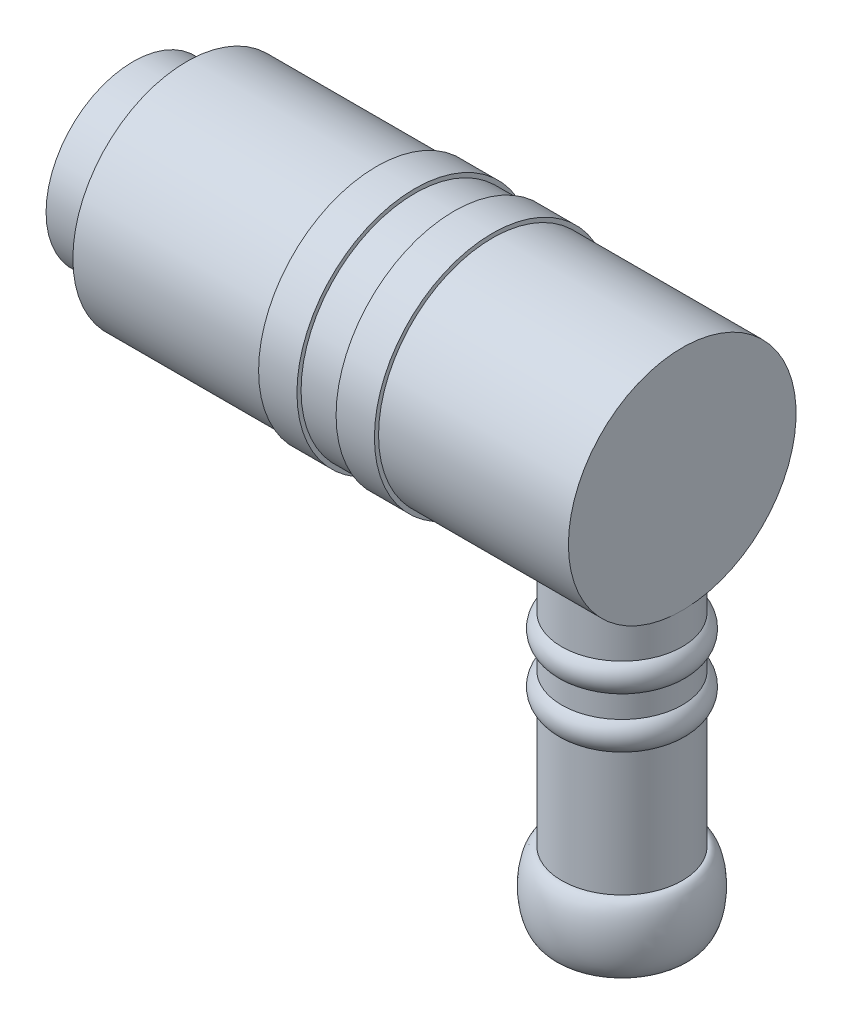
ISO-10303-21;
HEADER;
FILE_DESCRIPTION(('STEP AP214'),'2;1');
FILE_NAME('part.step','',(''),(''),'','','');
FILE_SCHEMA(('AUTOMOTIVE_DESIGN { 1 0 10303 214 1 1 1 1 }'));
ENDSEC;
DATA;
#1=APPLICATION_CONTEXT('core data for automotive mechanical design processes');
#2=APPLICATION_PROTOCOL_DEFINITION('international standard','automotive_design',2000,#1);
#3=PRODUCT_CONTEXT('',#1,'mechanical');
#4=PRODUCT('Part','Part','',(#3));
#5=PRODUCT_RELATED_PRODUCT_CATEGORY('part','',(#4));
#6=PRODUCT_DEFINITION_FORMATION('','',#4);
#7=PRODUCT_DEFINITION_CONTEXT('part definition',#1,'design');
#8=PRODUCT_DEFINITION('design','',#6,#7);
#9=PRODUCT_DEFINITION_SHAPE('','',#8);
#10=(LENGTH_UNIT() NAMED_UNIT(*) SI_UNIT(.MILLI.,.METRE.));
#11=(NAMED_UNIT(*) PLANE_ANGLE_UNIT() SI_UNIT($,.RADIAN.));
#12=(NAMED_UNIT(*) SI_UNIT($,.STERADIAN.) SOLID_ANGLE_UNIT());
#13=UNCERTAINTY_MEASURE_WITH_UNIT(LENGTH_MEASURE(1.E-05),#10,'distance_accuracy_value','');
#14=(GEOMETRIC_REPRESENTATION_CONTEXT(3) GLOBAL_UNCERTAINTY_ASSIGNED_CONTEXT((#13)) GLOBAL_UNIT_ASSIGNED_CONTEXT((#10,
#11,#12)) REPRESENTATION_CONTEXT('',''));
#15=CARTESIAN_POINT('',(0.,0.,0.));
#16=DIRECTION('',(0.,0.,1.));
#17=DIRECTION('',(1.,0.,0.));
#18=AXIS2_PLACEMENT_3D('',#15,#16,#17);
#19=CARTESIAN_POINT('',(36.5,-11.9034368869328,0.));
#20=DIRECTION('',(0.,1.,0.));
#21=DIRECTION('',(0.,0.,1.));
#22=AXIS2_PLACEMENT_3D('',#19,#20,#21);
#23=TOROIDAL_SURFACE('',#22,3.75173905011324,1.29418465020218);
#24=CARTESIAN_POINT('',(36.5,-10.8474920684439,0.));
#25=DIRECTION('',(0.,1.,0.));
#26=DIRECTION('',(0.,0.,1.));
#27=AXIS2_PLACEMENT_3D('',#24,#25,#26);
#28=CIRCLE('',#27,4.5);
#29=CARTESIAN_POINT('',(36.5,-10.8474920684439,4.5));
#30=VERTEX_POINT('',#29);
#31=EDGE_CURVE('P0_E9',#30,#30,#28,.T.);
#32=ORIENTED_EDGE('',*,*,#31,.F.);
#33=EDGE_LOOP('',(#32));
#34=FACE_BOUND('',#33,.T.);
#35=CARTESIAN_POINT('',(36.5,-12.9593817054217,0.));
#36=DIRECTION('',(0.,1.,0.));
#37=DIRECTION('',(0.,0.,1.));
#38=AXIS2_PLACEMENT_3D('',#35,#36,#37);
#39=CIRCLE('',#38,4.5);
#40=CARTESIAN_POINT('',(36.5,-12.9593817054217,4.5));
#41=VERTEX_POINT('',#40);
#42=EDGE_CURVE('P0_E45',#41,#41,#39,.T.);
#43=ORIENTED_EDGE('',*,*,#42,.T.);
#44=EDGE_LOOP('',(#43));
#45=FACE_BOUND('',#44,.T.);
#46=ADVANCED_FACE('P0_F14',(#34,#45),#23,.T.);
#47=CARTESIAN_POINT('',(36.5,-7.25890660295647,0.));
#48=DIRECTION('',(0.,1.,0.));
#49=DIRECTION('',(0.,0.,1.));
#50=AXIS2_PLACEMENT_3D('',#47,#48,#49);
#51=CYLINDRICAL_SURFACE('',#50,4.5);
#52=CARTESIAN_POINT('',(36.5,-7.25890660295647,0.));
#53=DIRECTION('',(0.,1.,0.));
#54=DIRECTION('',(0.,0.,1.));
#55=AXIS2_PLACEMENT_3D('',#52,#53,#54);
#56=CIRCLE('',#55,4.5);
#57=CARTESIAN_POINT('',(36.5,-7.25890660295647,4.5));
#58=VERTEX_POINT('',#57);
#59=EDGE_CURVE('P0_E20',#58,#58,#56,.T.);
#60=ORIENTED_EDGE('',*,*,#59,.F.);
#61=EDGE_LOOP('',(#60));
#62=FACE_BOUND('',#61,.T.);
#63=ORIENTED_EDGE('',*,*,#31,.T.);
#64=EDGE_LOOP('',(#63));
#65=FACE_BOUND('',#64,.T.);
#66=ADVANCED_FACE('P0_F67',(#62,#65),#51,.T.);
#67=CARTESIAN_POINT('',(39.5,-7.25890660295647,0.));
#68=DIRECTION('',(0.,-1.,0.));
#69=DIRECTION('',(0.,0.,-1.));
#70=AXIS2_PLACEMENT_3D('',#67,#68,#69);
#71=PLANE('',#70);
#72=CARTESIAN_POINT('',(36.5,-7.25890660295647,0.));
#73=DIRECTION('',(0.,1.,0.));
#74=DIRECTION('',(0.,0.,1.));
#75=AXIS2_PLACEMENT_3D('',#72,#73,#74);
#76=CIRCLE('',#75,3.);
#77=CARTESIAN_POINT('',(36.5,-7.25890660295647,3.));
#78=VERTEX_POINT('',#77);
#79=EDGE_CURVE('P0_E24',#78,#78,#76,.T.);
#80=ORIENTED_EDGE('',*,*,#79,.F.);
#81=EDGE_LOOP('',(#80));
#82=FACE_BOUND('',#81,.T.);
#83=ORIENTED_EDGE('',*,*,#59,.T.);
#84=EDGE_LOOP('',(#83));
#85=FACE_BOUND('',#84,.T.);
#86=ADVANCED_FACE('P0_F64',(#82,#85),#71,.F.);
#87=CARTESIAN_POINT('',(36.5,-7.25890660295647,0.));
#88=DIRECTION('',(0.,1.,0.));
#89=DIRECTION('',(0.,0.,1.));
#90=AXIS2_PLACEMENT_3D('',#87,#88,#89);
#91=CYLINDRICAL_SURFACE('',#90,3.);
#92=CARTESIAN_POINT('',(36.5,-31.2588721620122,0.));
#93=DIRECTION('',(0.,1.,0.));
#94=DIRECTION('',(0.,0.,1.));
#95=AXIS2_PLACEMENT_3D('',#92,#93,#94);
#96=CIRCLE('',#95,3.);
#97=CARTESIAN_POINT('',(36.5,-31.2588721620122,3.));
#98=VERTEX_POINT('',#97);
#99=EDGE_CURVE('P0_E28',#98,#98,#96,.T.);
#100=ORIENTED_EDGE('',*,*,#99,.F.);
#101=EDGE_LOOP('',(#100));
#102=FACE_BOUND('',#101,.T.);
#103=ORIENTED_EDGE('',*,*,#79,.T.);
#104=EDGE_LOOP('',(#103));
#105=FACE_BOUND('',#104,.T.);
#106=ADVANCED_FACE('P0_F60',(#102,#105),#91,.F.);
#107=CARTESIAN_POINT('',(40.9593408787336,-31.2588721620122,0.));
#108=DIRECTION('',(0.,1.,0.));
#109=DIRECTION('',(0.,0.,1.));
#110=AXIS2_PLACEMENT_3D('',#107,#108,#109);
#111=PLANE('',#110);
#112=CARTESIAN_POINT('',(36.5,-31.2588721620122,0.));
#113=DIRECTION('',(0.,1.,0.));
#114=DIRECTION('',(0.,0.,1.));
#115=AXIS2_PLACEMENT_3D('',#112,#113,#114);
#116=CIRCLE('',#115,4.45934087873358);
#117=CARTESIAN_POINT('',(36.5,-31.2588721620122,4.45934087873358));
#118=VERTEX_POINT('',#117);
#119=EDGE_CURVE('P0_E33',#118,#118,#116,.T.);
#120=ORIENTED_EDGE('',*,*,#119,.F.);
#121=EDGE_LOOP('',(#120));
#122=FACE_BOUND('',#121,.T.);
#123=ORIENTED_EDGE('',*,*,#99,.T.);
#124=EDGE_LOOP('',(#123));
#125=FACE_BOUND('',#124,.T.);
#126=ADVANCED_FACE('P0_F55',(#122,#125),#111,.F.);
#127=CARTESIAN_POINT('',(41.,-28.611956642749,0.));
#128=DIRECTION('',(0.,0.,1.));
#129=DIRECTION('',(-0.0153591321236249,-0.999882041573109,0.));
#130=AXIS2_PLACEMENT_3D('',#127,#128,#129);
#131=ELLIPSE('',#130,2.64722778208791,1.02803517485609);
#132=CARTESIAN_POINT('',(36.5,-7.25890660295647,0.));
#133=DIRECTION('',(0.,1.,0.));
#134=AXIS1_PLACEMENT('',#132,#133);
#135=SURFACE_OF_REVOLUTION('',#131,#134);
#136=CARTESIAN_POINT('',(36.5,-25.9664853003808,0.));
#137=DIRECTION('',(0.,1.,0.));
#138=DIRECTION('',(0.,0.,1.));
#139=AXIS2_PLACEMENT_3D('',#136,#137,#138);
#140=CIRCLE('',#139,4.5);
#141=CARTESIAN_POINT('',(36.5,-25.9664853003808,4.5));
#142=VERTEX_POINT('',#141);
#143=EDGE_CURVE('P0_E36',#142,#142,#140,.T.);
#144=ORIENTED_EDGE('',*,*,#143,.F.);
#145=EDGE_LOOP('',(#144));
#146=FACE_BOUND('',#145,.T.);
#147=ORIENTED_EDGE('',*,*,#119,.T.);
#148=EDGE_LOOP('',(#147));
#149=FACE_BOUND('',#148,.T.);
#150=ADVANCED_FACE('P0_F50',(#146,#149),#135,.T.);
#151=CARTESIAN_POINT('',(36.5,-7.25890660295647,0.));
#152=DIRECTION('',(0.,1.,0.));
#153=DIRECTION('',(0.,0.,1.));
#154=AXIS2_PLACEMENT_3D('',#151,#152,#153);
#155=CYLINDRICAL_SURFACE('',#154,4.5);
#156=CARTESIAN_POINT('',(36.5,-16.7283224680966,0.));
#157=DIRECTION('',(0.,1.,0.));
#158=DIRECTION('',(0.,0.,1.));
#159=AXIS2_PLACEMENT_3D('',#156,#157,#158);
#160=CIRCLE('',#159,4.5);
#161=CARTESIAN_POINT('',(36.5,-16.7283224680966,4.5));
#162=VERTEX_POINT('',#161);
#163=EDGE_CURVE('P0_E39',#162,#162,#160,.T.);
#164=ORIENTED_EDGE('',*,*,#163,.F.);
#165=EDGE_LOOP('',(#164));
#166=FACE_BOUND('',#165,.T.);
#167=ORIENTED_EDGE('',*,*,#143,.T.);
#168=EDGE_LOOP('',(#167));
#169=FACE_BOUND('',#168,.T.);
#170=ADVANCED_FACE('P0_F54',(#166,#169),#155,.T.);
#171=CARTESIAN_POINT('',(36.5,-15.6723776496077,0.));
#172=DIRECTION('',(0.,1.,0.));
#173=DIRECTION('',(0.,0.,1.));
#174=AXIS2_PLACEMENT_3D('',#171,#172,#173);
#175=TOROIDAL_SURFACE('',#174,3.75173905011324,1.29418465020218);
#176=CARTESIAN_POINT('',(36.5,-14.6164328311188,0.));
#177=DIRECTION('',(0.,1.,0.));
#178=DIRECTION('',(0.,0.,1.));
#179=AXIS2_PLACEMENT_3D('',#176,#177,#178);
#180=CIRCLE('',#179,4.5);
#181=CARTESIAN_POINT('',(36.5,-14.6164328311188,4.5));
#182=VERTEX_POINT('',#181);
#183=EDGE_CURVE('P0_E42',#182,#182,#180,.T.);
#184=ORIENTED_EDGE('',*,*,#183,.F.);
#185=EDGE_LOOP('',(#184));
#186=FACE_BOUND('',#185,.T.);
#187=ORIENTED_EDGE('',*,*,#163,.T.);
#188=EDGE_LOOP('',(#187));
#189=FACE_BOUND('',#188,.T.);
#190=ADVANCED_FACE('P0_F86',(#186,#189),#175,.T.);
#191=CARTESIAN_POINT('',(36.5,-7.25890660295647,0.));
#192=DIRECTION('',(0.,1.,0.));
#193=DIRECTION('',(0.,0.,1.));
#194=AXIS2_PLACEMENT_3D('',#191,#192,#193);
#195=CYLINDRICAL_SURFACE('',#194,4.5);
#196=ORIENTED_EDGE('',*,*,#42,.F.);
#197=EDGE_LOOP('',(#196));
#198=FACE_BOUND('',#197,.T.);
#199=ORIENTED_EDGE('',*,*,#183,.T.);
#200=EDGE_LOOP('',(#199));
#201=FACE_BOUND('',#200,.T.);
#202=ADVANCED_FACE('P0_F83',(#198,#201),#195,.T.);
#203=CLOSED_SHELL('',(#46,#66,#86,#106,#126,#150,#170,#190,#202));
#204=MANIFOLD_SOLID_BREP('P0_B1',#203);
#205=CARTESIAN_POINT('',(18.1763793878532,8.5,0.));
#206=DIRECTION('',(1.,0.,0.));
#207=DIRECTION('',(0.,0.,-1.));
#208=AXIS2_PLACEMENT_3D('',#205,#206,#207);
#209=PLANE('',#208);
#210=CARTESIAN_POINT('',(18.1763793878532,0.,0.));
#211=DIRECTION('',(-1.,0.,0.));
#212=DIRECTION('',(0.,0.,1.));
#213=AXIS2_PLACEMENT_3D('',#210,#211,#212);
#214=CIRCLE('',#213,8.5);
#215=CARTESIAN_POINT('',(18.1763793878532,0.,8.5));
#216=VERTEX_POINT('',#215);
#217=EDGE_CURVE('P1_E113',#216,#216,#214,.T.);
#218=ORIENTED_EDGE('',*,*,#217,.F.);
#219=EDGE_LOOP('',(#218));
#220=FACE_BOUND('',#219,.T.);
#221=CARTESIAN_POINT('',(18.1763793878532,0.,0.));
#222=DIRECTION('',(-1.,0.,0.));
#223=DIRECTION('',(0.,0.,1.));
#224=AXIS2_PLACEMENT_3D('',#221,#222,#223);
#225=CIRCLE('',#224,8.80809565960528);
#226=CARTESIAN_POINT('',(18.1763793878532,0.,8.80809565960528));
#227=VERTEX_POINT('',#226);
#228=EDGE_CURVE('P1_E155',#227,#227,#225,.T.);
#229=ORIENTED_EDGE('',*,*,#228,.T.);
#230=EDGE_LOOP('',(#229));
#231=FACE_BOUND('',#230,.T.);
#232=ADVANCED_FACE('P1_F16',(#220,#231),#209,.F.);
#233=CARTESIAN_POINT('',(0.,0.,0.));
#234=DIRECTION('',(-1.,0.,0.));
#235=DIRECTION('',(0.,0.,1.));
#236=AXIS2_PLACEMENT_3D('',#233,#234,#235);
#237=CYLINDRICAL_SURFACE('',#236,8.80809565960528);
#238=ORIENTED_EDGE('',*,*,#228,.F.);
#239=EDGE_LOOP('',(#238));
#240=FACE_BOUND('',#239,.T.);
#241=CARTESIAN_POINT('',(21.0389220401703,0.,0.));
#242=DIRECTION('',(-1.,0.,0.));
#243=DIRECTION('',(0.,0.,1.));
#244=AXIS2_PLACEMENT_3D('',#241,#242,#243);
#245=CIRCLE('',#244,8.80809565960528);
#246=CARTESIAN_POINT('',(21.0389220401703,0.,8.80809565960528));
#247=VERTEX_POINT('',#246);
#248=EDGE_CURVE('P1_E158',#247,#247,#245,.T.);
#249=ORIENTED_EDGE('',*,*,#248,.T.);
#250=EDGE_LOOP('',(#249));
#251=FACE_BOUND('',#250,.T.);
#252=ADVANCED_FACE('P1_F142',(#240,#251),#237,.T.);
#253=CARTESIAN_POINT('',(21.0389220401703,8.80809565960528,0.));
#254=DIRECTION('',(-1.,0.,0.));
#255=DIRECTION('',(0.,0.,1.));
#256=AXIS2_PLACEMENT_3D('',#253,#254,#255);
#257=PLANE('',#256);
#258=ORIENTED_EDGE('',*,*,#248,.F.);
#259=EDGE_LOOP('',(#258));
#260=FACE_BOUND('',#259,.T.);
#261=CARTESIAN_POINT('',(21.0389220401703,0.,0.));
#262=DIRECTION('',(-1.,0.,0.));
#263=DIRECTION('',(0.,0.,1.));
#264=AXIS2_PLACEMENT_3D('',#261,#262,#263);
#265=CIRCLE('',#264,8.5);
#266=CARTESIAN_POINT('',(21.0389220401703,0.,8.5));
#267=VERTEX_POINT('',#266);
#268=EDGE_CURVE('P1_E159',#267,#267,#265,.T.);
#269=ORIENTED_EDGE('',*,*,#268,.T.);
#270=EDGE_LOOP('',(#269));
#271=FACE_BOUND('',#270,.T.);
#272=ADVANCED_FACE('P1_F139',(#260,#271),#257,.F.);
#273=CARTESIAN_POINT('',(0.,0.,0.));
#274=DIRECTION('',(-1.,0.,0.));
#275=DIRECTION('',(0.,0.,1.));
#276=AXIS2_PLACEMENT_3D('',#273,#274,#275);
#277=CYLINDRICAL_SURFACE('',#276,8.5);
#278=ORIENTED_EDGE('',*,*,#268,.F.);
#279=EDGE_LOOP('',(#278));
#280=FACE_BOUND('',#279,.T.);
#281=CARTESIAN_POINT('',(23.9610779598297,0.,0.));
#282=DIRECTION('',(-1.,0.,0.));
#283=DIRECTION('',(0.,0.,1.));
#284=AXIS2_PLACEMENT_3D('',#281,#282,#283);
#285=CIRCLE('',#284,8.5);
#286=CARTESIAN_POINT('',(23.9610779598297,0.,8.5));
#287=VERTEX_POINT('',#286);
#288=EDGE_CURVE('P1_E164',#287,#287,#285,.T.);
#289=ORIENTED_EDGE('',*,*,#288,.T.);
#290=EDGE_LOOP('',(#289));
#291=FACE_BOUND('',#290,.T.);
#292=ADVANCED_FACE('P1_F135',(#280,#291),#277,.T.);
#293=CARTESIAN_POINT('',(23.9610779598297,8.80809565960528,0.));
#294=DIRECTION('',(1.,0.,0.));
#295=DIRECTION('',(0.,0.,-1.));
#296=AXIS2_PLACEMENT_3D('',#293,#294,#295);
#297=PLANE('',#296);
#298=ORIENTED_EDGE('',*,*,#288,.F.);
#299=EDGE_LOOP('',(#298));
#300=FACE_BOUND('',#299,.T.);
#301=CARTESIAN_POINT('',(23.9610779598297,0.,0.));
#302=DIRECTION('',(-1.,0.,0.));
#303=DIRECTION('',(0.,0.,1.));
#304=AXIS2_PLACEMENT_3D('',#301,#302,#303);
#305=CIRCLE('',#304,8.80809565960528);
#306=CARTESIAN_POINT('',(23.9610779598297,0.,8.80809565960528));
#307=VERTEX_POINT('',#306);
#308=EDGE_CURVE('P1_E191',#307,#307,#305,.T.);
#309=ORIENTED_EDGE('',*,*,#308,.T.);
#310=EDGE_LOOP('',(#309));
#311=FACE_BOUND('',#310,.T.);
#312=ADVANCED_FACE('P1_F131',(#300,#311),#297,.F.);
#313=CARTESIAN_POINT('',(0.,0.,0.));
#314=DIRECTION('',(-1.,0.,0.));
#315=DIRECTION('',(0.,0.,1.));
#316=AXIS2_PLACEMENT_3D('',#313,#314,#315);
#317=CYLINDRICAL_SURFACE('',#316,8.80809565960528);
#318=ORIENTED_EDGE('',*,*,#308,.F.);
#319=EDGE_LOOP('',(#318));
#320=FACE_BOUND('',#319,.T.);
#321=CARTESIAN_POINT('',(26.8236206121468,0.,0.));
#322=DIRECTION('',(-1.,0.,0.));
#323=DIRECTION('',(0.,0.,1.));
#324=AXIS2_PLACEMENT_3D('',#321,#322,#323);
#325=CIRCLE('',#324,8.80809565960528);
#326=CARTESIAN_POINT('',(26.8236206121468,0.,8.80809565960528));
#327=VERTEX_POINT('',#326);
#328=EDGE_CURVE('P1_E188',#327,#327,#325,.T.);
#329=ORIENTED_EDGE('',*,*,#328,.T.);
#330=EDGE_LOOP('',(#329));
#331=FACE_BOUND('',#330,.T.);
#332=ADVANCED_FACE('P1_F127',(#320,#331),#317,.T.);
#333=CARTESIAN_POINT('',(26.8236206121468,8.5,0.));
#334=DIRECTION('',(-1.,0.,0.));
#335=DIRECTION('',(0.,0.,1.));
#336=AXIS2_PLACEMENT_3D('',#333,#334,#335);
#337=PLANE('',#336);
#338=ORIENTED_EDGE('',*,*,#328,.F.);
#339=EDGE_LOOP('',(#338));
#340=FACE_BOUND('',#339,.T.);
#341=CARTESIAN_POINT('',(26.8236206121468,0.,0.));
#342=DIRECTION('',(-1.,0.,0.));
#343=DIRECTION('',(0.,0.,1.));
#344=AXIS2_PLACEMENT_3D('',#341,#342,#343);
#345=CIRCLE('',#344,8.5);
#346=CARTESIAN_POINT('',(26.8236206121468,0.,8.5));
#347=VERTEX_POINT('',#346);
#348=EDGE_CURVE('P1_E179',#347,#347,#345,.T.);
#349=ORIENTED_EDGE('',*,*,#348,.T.);
#350=EDGE_LOOP('',(#349));
#351=FACE_BOUND('',#350,.T.);
#352=ADVANCED_FACE('P1_F123',(#340,#351),#337,.F.);
#353=CARTESIAN_POINT('',(0.,0.,0.));
#354=DIRECTION('',(-1.,0.,0.));
#355=DIRECTION('',(0.,0.,1.));
#356=AXIS2_PLACEMENT_3D('',#353,#354,#355);
#357=CYLINDRICAL_SURFACE('',#356,8.5);
#358=CARTESIAN_POINT('',(36.5,-8.26135582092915,-2.));
#359=CARTESIAN_POINT('',(36.3893406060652,-8.26135802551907,-1.99999651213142));
#360=CARTESIAN_POINT('',(36.2786410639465,-8.26360346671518,-1.99078460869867));
#361=CARTESIAN_POINT('',(36.0604059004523,-8.27232284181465,-1.95423010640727));
#362=CARTESIAN_POINT('',(35.9528723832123,-8.2787995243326,-1.92687572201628));
#363=CARTESIAN_POINT('',(35.744157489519,-8.29520817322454,-1.85495833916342));
#364=CARTESIAN_POINT('',(35.6429686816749,-8.30513600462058,-1.81041592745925));
#365=CARTESIAN_POINT('',(35.4494931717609,-8.32732327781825,-1.70544786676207));
#366=CARTESIAN_POINT('',(35.3572065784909,-8.33958274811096,-1.64502202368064));
#367=CARTESIAN_POINT('',(35.1823536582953,-8.36531956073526,-1.50874395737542));
#368=CARTESIAN_POINT('',(35.0999865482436,-8.37881451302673,-1.43263940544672));
#369=CARTESIAN_POINT('',(34.9490607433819,-8.40534831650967,-1.26770837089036));
#370=CARTESIAN_POINT('',(34.8805032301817,-8.41838712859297,-1.17888080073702));
#371=CARTESIAN_POINT('',(34.7583407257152,-8.44273291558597,-0.989674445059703));
#372=CARTESIAN_POINT('',(34.7049294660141,-8.45401668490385,-0.889167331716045));
#373=CARTESIAN_POINT('',(34.6158321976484,-8.47338106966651,-0.680292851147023));
#374=CARTESIAN_POINT('',(34.5801438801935,-8.48146210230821,-0.571926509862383));
#375=CARTESIAN_POINT('',(34.5281380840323,-8.49338603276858,-0.352484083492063));
#376=CARTESIAN_POINT('',(34.5114828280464,-8.49730274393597,-0.241492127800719));
#377=CARTESIAN_POINT('',(34.4969577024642,-8.5007132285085,-0.0182250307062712));
#378=CARTESIAN_POINT('',(34.4990853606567,-8.50020758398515,0.0940499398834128));
#379=CARTESIAN_POINT('',(34.5218185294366,-8.49488598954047,0.314360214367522));
#380=CARTESIAN_POINT('',(34.5420597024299,-8.49015503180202,0.422435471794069));
#381=CARTESIAN_POINT('',(34.5998621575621,-8.47701229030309,0.633610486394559));
#382=CARTESIAN_POINT('',(34.6374242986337,-8.4686003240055,0.736709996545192));
#383=CARTESIAN_POINT('',(34.7291104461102,-8.44890746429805,0.935991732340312));
#384=CARTESIAN_POINT('',(34.7833681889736,-8.43760353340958,1.03211005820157));
#385=CARTESIAN_POINT('',(34.9068047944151,-8.41335949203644,1.21400773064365));
#386=CARTESIAN_POINT('',(34.9759859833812,-8.40041912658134,1.29978546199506));
#387=CARTESIAN_POINT('',(35.1292738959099,-8.37395173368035,1.46073740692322));
#388=CARTESIAN_POINT('',(35.2136993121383,-8.36041808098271,1.53560731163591));
#389=CARTESIAN_POINT('',(35.394048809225,-8.33457724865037,1.67018914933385));
#390=CARTESIAN_POINT('',(35.489973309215,-8.32227011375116,1.72990052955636));
#391=CARTESIAN_POINT('',(35.691143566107,-8.30025483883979,1.83263569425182));
#392=CARTESIAN_POINT('',(35.796423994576,-8.29055695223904,1.87559393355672));
#393=CARTESIAN_POINT('',(36.0129937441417,-8.27499423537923,1.94311185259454));
#394=CARTESIAN_POINT('',(36.1242819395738,-8.26912868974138,1.96767496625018));
#395=CARTESIAN_POINT('',(36.3469061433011,-8.2620429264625,1.99721658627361));
#396=CARTESIAN_POINT('',(36.4581795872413,-8.2607167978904,2.0026417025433));
#397=CARTESIAN_POINT('',(36.6800412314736,-8.2625729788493,1.99496945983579));
#398=CARTESIAN_POINT('',(36.7906294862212,-8.26575492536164,1.98187359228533));
#399=CARTESIAN_POINT('',(37.0063738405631,-8.27616794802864,1.93792079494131));
#400=CARTESIAN_POINT('',(37.1115845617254,-8.28334127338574,1.90731701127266));
#401=CARTESIAN_POINT('',(37.3153840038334,-8.30087529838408,1.82949455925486));
#402=CARTESIAN_POINT('',(37.4139720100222,-8.31123634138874,1.78227410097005));
#403=CARTESIAN_POINT('',(37.6036394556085,-8.33420606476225,1.67160019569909));
#404=CARTESIAN_POINT('',(37.6945562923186,-8.34685107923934,1.60787579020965));
#405=CARTESIAN_POINT('',(37.8645701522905,-8.37287165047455,1.46635124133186));
#406=CARTESIAN_POINT('',(37.9436654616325,-8.38624731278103,1.38854906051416));
#407=CARTESIAN_POINT('',(38.0895632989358,-8.41257627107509,1.21904159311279));
#408=CARTESIAN_POINT('',(38.1560590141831,-8.42551392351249,1.12706936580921));
#409=CARTESIAN_POINT('',(38.2726585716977,-8.44920397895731,0.933002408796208));
#410=CARTESIAN_POINT('',(38.3227632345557,-8.45995649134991,0.830908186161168));
#411=CARTESIAN_POINT('',(38.4047506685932,-8.47799969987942,0.620174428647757));
#412=CARTESIAN_POINT('',(38.4367580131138,-8.48531400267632,0.511585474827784));
#413=CARTESIAN_POINT('',(38.4820243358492,-8.4957594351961,0.290377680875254));
#414=CARTESIAN_POINT('',(38.4952864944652,-8.49889127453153,0.17775952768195));
#415=CARTESIAN_POINT('',(38.5025243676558,-8.50059376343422,-0.0454132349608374));
#416=CARTESIAN_POINT('',(38.4969553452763,-8.49927208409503,-0.155952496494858));
#417=CARTESIAN_POINT('',(38.4677198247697,-8.49245087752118,-0.374472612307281));
#418=CARTESIAN_POINT('',(38.4440537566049,-8.48695144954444,-0.482453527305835));
#419=CARTESIAN_POINT('',(38.3795280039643,-8.47240518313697,-0.692375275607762));
#420=CARTESIAN_POINT('',(38.3387421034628,-8.46337357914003,-0.794339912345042));
#421=CARTESIAN_POINT('',(38.2412031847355,-8.4427202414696,-0.990034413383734));
#422=CARTESIAN_POINT('',(38.1844483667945,-8.43109821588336,-1.0837633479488));
#423=CARTESIAN_POINT('',(38.0551475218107,-8.40621095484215,-1.26251541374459));
#424=CARTESIAN_POINT('',(37.9822870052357,-8.39291565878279,-1.34730688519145));
#425=CARTESIAN_POINT('',(37.8234652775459,-8.36632793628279,-1.50361474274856));
#426=CARTESIAN_POINT('',(37.737500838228,-8.35303551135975,-1.57512784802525));
#427=CARTESIAN_POINT('',(37.5532541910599,-8.3277185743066,-1.7039641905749));
#428=CARTESIAN_POINT('',(37.454796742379,-8.31571778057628,-1.76104180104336));
#429=CARTESIAN_POINT('',(37.2494196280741,-8.29465107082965,-1.85774896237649));
#430=CARTESIAN_POINT('',(37.1425066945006,-8.28558284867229,-1.89739223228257));
#431=CARTESIAN_POINT('',(36.9463577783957,-8.27295300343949,-1.95162562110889));
#432=CARTESIAN_POINT('',(36.858125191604,-8.26863485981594,-1.96972884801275));
#433=CARTESIAN_POINT('',(36.6799371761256,-8.26283546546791,-1.99391706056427));
#434=CARTESIAN_POINT('',(36.5899818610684,-8.2613540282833,-2.00000283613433));
#435=CARTESIAN_POINT('',(36.5,-8.26135582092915,-2.));
#436=B_SPLINE_CURVE_WITH_KNOTS('',3,(#358,#359,#360,#361,#362,#363,#364,#365,#366,#367,#368,
#369,#370,#371,#372,#373,#374,#375,#376,#377,#378,#379,#380,#381,#382,#383,#384,#385,#386,#387,
#388,#389,#390,#391,#392,#393,#394,#395,#396,#397,#398,#399,#400,#401,#402,#403,#404,#405,#406,
#407,#408,#409,#410,#411,#412,#413,#414,#415,#416,#417,#418,#419,#420,#421,#422,#423,#424,#425,
#426,#427,#428,#429,#430,#431,#432,#433,#434,#435),.UNSPECIFIED.,.T.,.F.,(4,2,2,2,2,2,2,2,2,2,2,
2,2,2,2,2,2,2,2,2,2,2,2,2,2,2,2,2,2,2,2,2,2,2,2,2,2,2,4),(0.,0.331648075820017,
0.663511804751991,0.994979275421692,1.32645079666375,1.66374480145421,2.00106765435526,
2.34252829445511,2.6839444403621,3.01920253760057,3.35441650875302,3.68303582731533,
4.01167144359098,4.34301124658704,4.67440273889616,5.01375700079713,5.35312363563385,
5.69380500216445,6.03442275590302,6.36703716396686,6.69962478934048,7.02752088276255,
7.35545230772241,7.68915273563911,8.02290149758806,8.36395228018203,8.70498598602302,
9.04364266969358,9.38224188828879,9.71271422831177,10.0431787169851,10.3722333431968,
10.7013250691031,11.037522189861,11.3738022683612,11.7154685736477,12.0568655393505,
12.3265604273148,12.5962375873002),.UNSPECIFIED.);
#437=CARTESIAN_POINT('',(36.5,-8.26135582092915,-2.));
#438=VERTEX_POINT('',#437);
#439=EDGE_CURVE('P1_E105',#438,#438,#436,.T.);
#440=ORIENTED_EDGE('',*,*,#439,.T.);
#441=EDGE_LOOP('',(#440));
#442=FACE_BOUND('',#441,.T.);
#443=ORIENTED_EDGE('',*,*,#348,.F.);
#444=EDGE_LOOP('',(#443));
#445=FACE_BOUND('',#444,.T.);
#446=CARTESIAN_POINT('',(41.,0.,0.));
#447=DIRECTION('',(-1.,0.,0.));
#448=DIRECTION('',(0.,0.,1.));
#449=AXIS2_PLACEMENT_3D('',#446,#447,#448);
#450=CIRCLE('',#449,8.5);
#451=CARTESIAN_POINT('',(41.,0.,8.5));
#452=VERTEX_POINT('',#451);
#453=EDGE_CURVE('P1_E175',#452,#452,#450,.T.);
#454=ORIENTED_EDGE('',*,*,#453,.T.);
#455=EDGE_LOOP('',(#454));
#456=FACE_BOUND('',#455,.T.);
#457=ADVANCED_FACE('P1_F117',(#442,#445,#456),#357,.T.);
#458=CARTESIAN_POINT('',(41.,4.,0.));
#459=DIRECTION('',(-1.,0.,0.));
#460=DIRECTION('',(0.,0.,1.));
#461=AXIS2_PLACEMENT_3D('',#458,#459,#460);
#462=PLANE('',#461);
#463=ORIENTED_EDGE('',*,*,#453,.F.);
#464=EDGE_LOOP('',(#463));
#465=FACE_BOUND('',#464,.T.);
#466=ADVANCED_FACE('P1_F122',(#465),#462,.F.);
#467=CARTESIAN_POINT('',(38.,0.,0.));
#468=DIRECTION('',(1.,0.,0.));
#469=DIRECTION('',(0.,0.,-1.));
#470=AXIS2_PLACEMENT_3D('',#467,#468,#469);
#471=PLANE('',#470);
#472=DIRECTION('',(0.,0.,1.));
#473=VECTOR('',#472,1.);
#474=CARTESIAN_POINT('',(38.,-4.2253404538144,0.));
#475=LINE('',#474,#473);
#476=CARTESIAN_POINT('',(38.,-4.2253404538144,-1.32287565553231));
#477=VERTEX_POINT('',#476);
#478=CARTESIAN_POINT('',(38.,-4.2253404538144,1.32287565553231));
#479=VERTEX_POINT('',#478);
#480=EDGE_CURVE('P1_E169',#477,#479,#475,.T.);
#481=ORIENTED_EDGE('',*,*,#480,.T.);
#482=DIRECTION('',(0.,-1.,0.));
#483=VECTOR('',#482,1.);
#484=CARTESIAN_POINT('',(38.,-31.2588721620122,1.32287565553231));
#485=LINE('',#484,#483);
#486=CARTESIAN_POINT('',(38.,-4.30116263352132,1.3228756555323));
#487=VERTEX_POINT('',#486);
#488=EDGE_CURVE('P1_E114',#479,#487,#485,.T.);
#489=ORIENTED_EDGE('',*,*,#488,.T.);
#490=CARTESIAN_POINT('',(38.,0.,0.));
#491=DIRECTION('',(-1.,0.,0.));
#492=DIRECTION('',(0.,0.,1.));
#493=AXIS2_PLACEMENT_3D('',#490,#491,#492);
#494=CIRCLE('',#493,4.5);
#495=CARTESIAN_POINT('',(38.,-4.30116263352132,-1.3228756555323));
#496=VERTEX_POINT('',#495);
#497=EDGE_CURVE('P1_E174',#487,#496,#494,.T.);
#498=ORIENTED_EDGE('',*,*,#497,.T.);
#499=DIRECTION('',(0.,-1.,0.));
#500=VECTOR('',#499,1.);
#501=CARTESIAN_POINT('',(38.,-31.2588721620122,-1.32287565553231));
#502=LINE('',#501,#500);
#503=EDGE_CURVE('P1_E67',#496,#477,#502,.F.);
#504=ORIENTED_EDGE('',*,*,#503,.T.);
#505=EDGE_LOOP('',(#481,#489,#498,#504));
#506=FACE_BOUND('',#505,.T.);
#507=ADVANCED_FACE('P1_F173',(#506),#471,.F.);
#508=CARTESIAN_POINT('',(0.,0.,0.));
#509=DIRECTION('',(-1.,0.,0.));
#510=DIRECTION('',(0.,0.,1.));
#511=AXIS2_PLACEMENT_3D('',#508,#509,#510);
#512=CYLINDRICAL_SURFACE('',#511,4.5);
#513=DIRECTION('',(-1.,0.,0.));
#514=VECTOR('',#513,1.);
#515=CARTESIAN_POINT('',(0.,-4.2253404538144,-1.54806267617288));
#516=LINE('',#515,#514);
#517=CARTESIAN_POINT('',(35.2337054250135,-4.2253404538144,-1.54806267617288));
#518=VERTEX_POINT('',#517);
#519=CARTESIAN_POINT('',(37.7662945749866,-4.2253404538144,-1.54806267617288));
#520=VERTEX_POINT('',#519);
#521=EDGE_CURVE('P1_E29',#518,#520,#516,.F.);
#522=ORIENTED_EDGE('',*,*,#521,.T.);
#523=CARTESIAN_POINT('',(37.7662945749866,-4.2253404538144,-1.54806267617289));
#524=CARTESIAN_POINT('',(37.7872743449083,-4.2316279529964,-1.53090156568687));
#525=CARTESIAN_POINT('',(37.8078987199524,-4.23795104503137,-1.51331919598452));
#526=CARTESIAN_POINT('',(37.8483792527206,-4.2506184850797,-1.47736422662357));
#527=CARTESIAN_POINT('',(37.8682365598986,-4.25696278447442,-1.45899290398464));
#528=CARTESIAN_POINT('',(37.9071912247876,-4.26964260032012,-1.42145855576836));
#529=CARTESIAN_POINT('',(37.9262885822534,-4.27597811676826,-1.40229552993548));
#530=CARTESIAN_POINT('',(37.9637270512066,-4.2886112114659,-1.36317181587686));
#531=CARTESIAN_POINT('',(37.9820669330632,-4.29490871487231,-1.34320992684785));
#532=CARTESIAN_POINT('',(38.,-4.30116263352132,-1.32287565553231));
#533=B_SPLINE_CURVE_WITH_KNOTS('',3,(#523,#524,#525,#526,#527,#528,#529,#530,#531,#532),
.UNSPECIFIED.,.F.,.F.,(4,2,2,2,4),(0.,0.0834670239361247,0.166803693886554,0.250140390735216,
0.333607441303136),.UNSPECIFIED.);
#534=EDGE_CURVE('P1_E10',#520,#496,#533,.T.);
#535=ORIENTED_EDGE('',*,*,#534,.T.);
#536=ORIENTED_EDGE('',*,*,#497,.F.);
#537=CARTESIAN_POINT('',(38.,-4.30116263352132,1.3228756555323));
#538=CARTESIAN_POINT('',(37.9820669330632,-4.2949087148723,1.34320992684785));
#539=CARTESIAN_POINT('',(37.9637270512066,-4.2886112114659,1.36317181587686));
#540=CARTESIAN_POINT('',(37.9262885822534,-4.27597811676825,1.40229552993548));
#541=CARTESIAN_POINT('',(37.9071912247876,-4.26964260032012,1.42145855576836));
#542=CARTESIAN_POINT('',(37.8682365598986,-4.25696278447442,1.45899290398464));
#543=CARTESIAN_POINT('',(37.8483792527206,-4.2506184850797,1.47736422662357));
#544=CARTESIAN_POINT('',(37.8078987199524,-4.23795104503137,1.51331919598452));
#545=CARTESIAN_POINT('',(37.7872743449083,-4.2316279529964,1.53090156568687));
#546=CARTESIAN_POINT('',(37.7662945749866,-4.2253404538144,1.54806267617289));
#547=B_SPLINE_CURVE_WITH_KNOTS('',3,(#537,#538,#539,#540,#541,#542,#543,#544,#545,#546),
.UNSPECIFIED.,.F.,.F.,(4,2,2,2,4),(0.,0.0834670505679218,0.166803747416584,0.250140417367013,
0.333607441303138),.UNSPECIFIED.);
#548=CARTESIAN_POINT('',(37.7662945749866,-4.2253404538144,1.54806267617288));
#549=VERTEX_POINT('',#548);
#550=EDGE_CURVE('P1_E42',#487,#549,#547,.T.);
#551=ORIENTED_EDGE('',*,*,#550,.T.);
#552=DIRECTION('',(-1.,0.,0.));
#553=VECTOR('',#552,1.);
#554=CARTESIAN_POINT('',(0.,-4.2253404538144,1.54806267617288));
#555=LINE('',#554,#553);
#556=CARTESIAN_POINT('',(35.2337054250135,-4.2253404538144,1.54806267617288));
#557=VERTEX_POINT('',#556);
#558=EDGE_CURVE('P1_E161',#549,#557,#555,.T.);
#559=ORIENTED_EDGE('',*,*,#558,.T.);
#560=CARTESIAN_POINT('',(35.2337054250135,-4.2253404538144,1.54806267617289));
#561=CARTESIAN_POINT('',(35.1901431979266,-4.23839742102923,1.51242372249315));
#562=CARTESIAN_POINT('',(35.1481289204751,-4.25160001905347,1.47499130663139));
#563=CARTESIAN_POINT('',(35.0673867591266,-4.27795758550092,1.39670628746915));
#564=CARTESIAN_POINT('',(35.0286594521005,-4.29111254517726,1.355853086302));
#565=CARTESIAN_POINT('',(34.9175572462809,-4.33004604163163,1.22824992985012));
#566=CARTESIAN_POINT('',(34.8504507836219,-4.35523421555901,1.13661085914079));
#567=CARTESIAN_POINT('',(34.7322434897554,-4.40136206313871,0.94233638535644));
#568=CARTESIAN_POINT('',(34.6811728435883,-4.42229369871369,0.839680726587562));
#569=CARTESIAN_POINT('',(34.5971345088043,-4.45751464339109,0.626267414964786));
#570=CARTESIAN_POINT('',(34.5641364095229,-4.47181510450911,0.515523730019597));
#571=CARTESIAN_POINT('',(34.5189455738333,-4.49156848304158,0.29552091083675));
#572=CARTESIAN_POINT('',(34.5057049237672,-4.49746621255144,0.186517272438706));
#573=CARTESIAN_POINT('',(34.4972673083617,-4.50121318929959,-0.0323452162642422));
#574=CARTESIAN_POINT('',(34.502070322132,-4.49906244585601,-0.142204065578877));
#575=CARTESIAN_POINT('',(34.5286865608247,-4.48730998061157,-0.352919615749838));
#576=CARTESIAN_POINT('',(34.5495014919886,-4.47814569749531,-0.45392981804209));
#577=CARTESIAN_POINT('',(34.6061064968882,-4.453782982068,-0.650900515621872));
#578=CARTESIAN_POINT('',(34.6419004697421,-4.43858297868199,-0.746859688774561));
#579=CARTESIAN_POINT('',(34.7285815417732,-4.40298924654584,-0.934392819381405));
#580=CARTESIAN_POINT('',(34.779907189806,-4.38244744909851,-1.02573453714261));
#581=CARTESIAN_POINT('',(34.8957072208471,-4.33830593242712,-1.19877899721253));
#582=CARTESIAN_POINT('',(34.9601737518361,-4.31470804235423,-1.28048744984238));
#583=CARTESIAN_POINT('',(35.062061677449,-4.27981127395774,-1.39086862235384));
#584=CARTESIAN_POINT('',(35.0948804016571,-4.26887894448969,-1.42401402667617));
#585=CARTESIAN_POINT('',(35.1626842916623,-4.24704445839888,-1.48786657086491));
#586=CARTESIAN_POINT('',(35.1976648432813,-4.23614228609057,-1.5185786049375));
#587=CARTESIAN_POINT('',(35.2337054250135,-4.2253404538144,-1.54806267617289));
#588=B_SPLINE_CURVE_WITH_KNOTS('',3,(#560,#561,#562,#563,#564,#565,#566,#567,#568,#569,#570,
#571,#572,#573,#574,#575,#576,#577,#578,#579,#580,#581,#582,#583,#584,#585,#586,#587),
.UNSPECIFIED.,.F.,.F.,(4,2,2,2,2,2,2,2,2,2,2,2,2,4),(0.,0.173229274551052,0.346488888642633,
0.69375169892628,1.04166431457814,1.38898968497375,1.71714261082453,2.04529515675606,
2.35449809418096,2.66378156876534,2.98277452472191,3.30157742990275,3.44521060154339,
3.58854713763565),.UNSPECIFIED.);
#589=EDGE_CURVE('P1_E79',#557,#518,#588,.T.);
#590=ORIENTED_EDGE('',*,*,#589,.T.);
#591=EDGE_LOOP('',(#522,#535,#536,#551,#559,#590));
#592=FACE_BOUND('',#591,.T.);
#593=CARTESIAN_POINT('',(0.,0.,0.));
#594=DIRECTION('',(-1.,0.,0.));
#595=DIRECTION('',(0.,0.,1.));
#596=AXIS2_PLACEMENT_3D('',#593,#594,#595);
#597=CIRCLE('',#596,4.5);
#598=CARTESIAN_POINT('',(0.,0.,4.5));
#599=VERTEX_POINT('',#598);
#600=EDGE_CURVE('P1_E176',#599,#599,#597,.T.);
#601=ORIENTED_EDGE('',*,*,#600,.T.);
#602=EDGE_LOOP('',(#601));
#603=FACE_BOUND('',#602,.T.);
#604=ADVANCED_FACE('P1_F76',(#592,#603),#512,.F.);
#605=CARTESIAN_POINT('',(0.,4.5,0.));
#606=DIRECTION('',(1.,0.,0.));
#607=DIRECTION('',(0.,0.,-1.));
#608=AXIS2_PLACEMENT_3D('',#605,#606,#607);
#609=PLANE('',#608);
#610=ORIENTED_EDGE('',*,*,#600,.F.);
#611=EDGE_LOOP('',(#610));
#612=FACE_BOUND('',#611,.T.);
#613=CARTESIAN_POINT('',(0.,0.,0.));
#614=DIRECTION('',(-1.,0.,0.));
#615=DIRECTION('',(0.,0.,1.));
#616=AXIS2_PLACEMENT_3D('',#613,#614,#615);
#617=CIRCLE('',#616,6.5);
#618=CARTESIAN_POINT('',(0.,0.,6.5));
#619=VERTEX_POINT('',#618);
#620=EDGE_CURVE('P1_E182',#619,#619,#617,.T.);
#621=ORIENTED_EDGE('',*,*,#620,.T.);
#622=EDGE_LOOP('',(#621));
#623=FACE_BOUND('',#622,.T.);
#624=ADVANCED_FACE('P1_F215',(#612,#623),#609,.F.);
#625=CARTESIAN_POINT('',(0.,0.,0.));
#626=DIRECTION('',(-1.,0.,0.));
#627=DIRECTION('',(0.,0.,1.));
#628=AXIS2_PLACEMENT_3D('',#625,#626,#627);
#629=CYLINDRICAL_SURFACE('',#628,6.5);
#630=ORIENTED_EDGE('',*,*,#620,.F.);
#631=EDGE_LOOP('',(#630));
#632=FACE_BOUND('',#631,.T.);
#633=CARTESIAN_POINT('',(4.,0.,0.));
#634=DIRECTION('',(-1.,0.,0.));
#635=DIRECTION('',(0.,0.,1.));
#636=AXIS2_PLACEMENT_3D('',#633,#634,#635);
#637=CIRCLE('',#636,6.5);
#638=CARTESIAN_POINT('',(4.,0.,6.5));
#639=VERTEX_POINT('',#638);
#640=EDGE_CURVE('P1_E241',#639,#639,#637,.T.);
#641=ORIENTED_EDGE('',*,*,#640,.T.);
#642=EDGE_LOOP('',(#641));
#643=FACE_BOUND('',#642,.T.);
#644=ADVANCED_FACE('P1_F220',(#632,#643),#629,.T.);
#645=CARTESIAN_POINT('',(4.,6.5,0.));
#646=DIRECTION('',(1.,0.,0.));
#647=DIRECTION('',(0.,0.,-1.));
#648=AXIS2_PLACEMENT_3D('',#645,#646,#647);
#649=PLANE('',#648);
#650=ORIENTED_EDGE('',*,*,#640,.F.);
#651=EDGE_LOOP('',(#650));
#652=FACE_BOUND('',#651,.T.);
#653=CARTESIAN_POINT('',(4.,0.,0.));
#654=DIRECTION('',(-1.,0.,0.));
#655=DIRECTION('',(0.,0.,1.));
#656=AXIS2_PLACEMENT_3D('',#653,#654,#655);
#657=CIRCLE('',#656,8.5);
#658=CARTESIAN_POINT('',(4.,0.,8.5));
#659=VERTEX_POINT('',#658);
#660=EDGE_CURVE('P1_E244',#659,#659,#657,.T.);
#661=ORIENTED_EDGE('',*,*,#660,.T.);
#662=EDGE_LOOP('',(#661));
#663=FACE_BOUND('',#662,.T.);
#664=ADVANCED_FACE('P1_F226',(#652,#663),#649,.F.);
#665=CARTESIAN_POINT('',(0.,0.,0.));
#666=DIRECTION('',(-1.,0.,0.));
#667=DIRECTION('',(0.,0.,1.));
#668=AXIS2_PLACEMENT_3D('',#665,#666,#667);
#669=CYLINDRICAL_SURFACE('',#668,8.5);
#670=ORIENTED_EDGE('',*,*,#660,.F.);
#671=EDGE_LOOP('',(#670));
#672=FACE_BOUND('',#671,.T.);
#673=ORIENTED_EDGE('',*,*,#217,.T.);
#674=EDGE_LOOP('',(#673));
#675=FACE_BOUND('',#674,.T.);
#676=ADVANCED_FACE('P1_F99',(#672,#675),#669,.T.);
#677=CARTESIAN_POINT('',(36.5,-31.2588721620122,0.));
#678=DIRECTION('',(0.,-1.,0.));
#679=DIRECTION('',(0.,0.,-1.));
#680=AXIS2_PLACEMENT_3D('',#677,#678,#679);
#681=CYLINDRICAL_SURFACE('',#680,2.);
#682=CARTESIAN_POINT('',(36.5,-4.2253404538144,0.));
#683=DIRECTION('',(0.,-1.,0.));
#684=DIRECTION('',(0.,0.,-1.));
#685=AXIS2_PLACEMENT_3D('',#682,#683,#684);
#686=CIRCLE('',#685,2.);
#687=EDGE_CURVE('P1_E75',#477,#479,#686,.T.);
#688=ORIENTED_EDGE('',*,*,#687,.F.);
#689=ORIENTED_EDGE('',*,*,#503,.F.);
#690=ORIENTED_EDGE('',*,*,#534,.F.);
#691=EDGE_CURVE('P1_E64',#518,#520,#686,.T.);
#692=ORIENTED_EDGE('',*,*,#691,.F.);
#693=ORIENTED_EDGE('',*,*,#589,.F.);
#694=EDGE_CURVE('P1_E35',#549,#557,#686,.T.);
#695=ORIENTED_EDGE('',*,*,#694,.F.);
#696=ORIENTED_EDGE('',*,*,#550,.F.);
#697=ORIENTED_EDGE('',*,*,#488,.F.);
#698=EDGE_LOOP('',(#688,#689,#690,#692,#693,#695,#696,#697));
#699=FACE_BOUND('',#698,.T.);
#700=ORIENTED_EDGE('',*,*,#439,.F.);
#701=EDGE_LOOP('',(#700));
#702=FACE_BOUND('',#701,.T.);
#703=ADVANCED_FACE('P1_F62',(#699,#702),#681,.F.);
#704=CARTESIAN_POINT('',(38.5,-4.2253404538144,0.));
#705=DIRECTION('',(0.,1.,0.));
#706=DIRECTION('',(0.,0.,1.));
#707=AXIS2_PLACEMENT_3D('',#704,#705,#706);
#708=PLANE('',#707);
#709=ORIENTED_EDGE('',*,*,#687,.T.);
#710=ORIENTED_EDGE('',*,*,#480,.F.);
#711=EDGE_LOOP('',(#709,#710));
#712=FACE_BOUND('',#711,.T.);
#713=ADVANCED_FACE('P1_F98',(#712),#708,.F.);
#714=ORIENTED_EDGE('',*,*,#691,.T.);
#715=ORIENTED_EDGE('',*,*,#521,.F.);
#716=EDGE_LOOP('',(#714,#715));
#717=FACE_BOUND('',#716,.T.);
#718=ADVANCED_FACE('P1_F73',(#717),#708,.F.);
#719=ORIENTED_EDGE('',*,*,#694,.T.);
#720=ORIENTED_EDGE('',*,*,#558,.F.);
#721=EDGE_LOOP('',(#719,#720));
#722=FACE_BOUND('',#721,.T.);
#723=ADVANCED_FACE('P1_F167',(#722),#708,.F.);
#724=CLOSED_SHELL('',(#232,#252,#272,#292,#312,#332,#352,#457,#466,#507,#604,#624,#644,#664,
#676,#703,#713,#718,#723));
#725=MANIFOLD_SOLID_BREP('P1_B1',#724);
#726=ADVANCED_BREP_SHAPE_REPRESENTATION('',(#18,#204,#725),#14);
#727=SHAPE_DEFINITION_REPRESENTATION(#9,#726);
ENDSEC;
END-ISO-10303-21;
